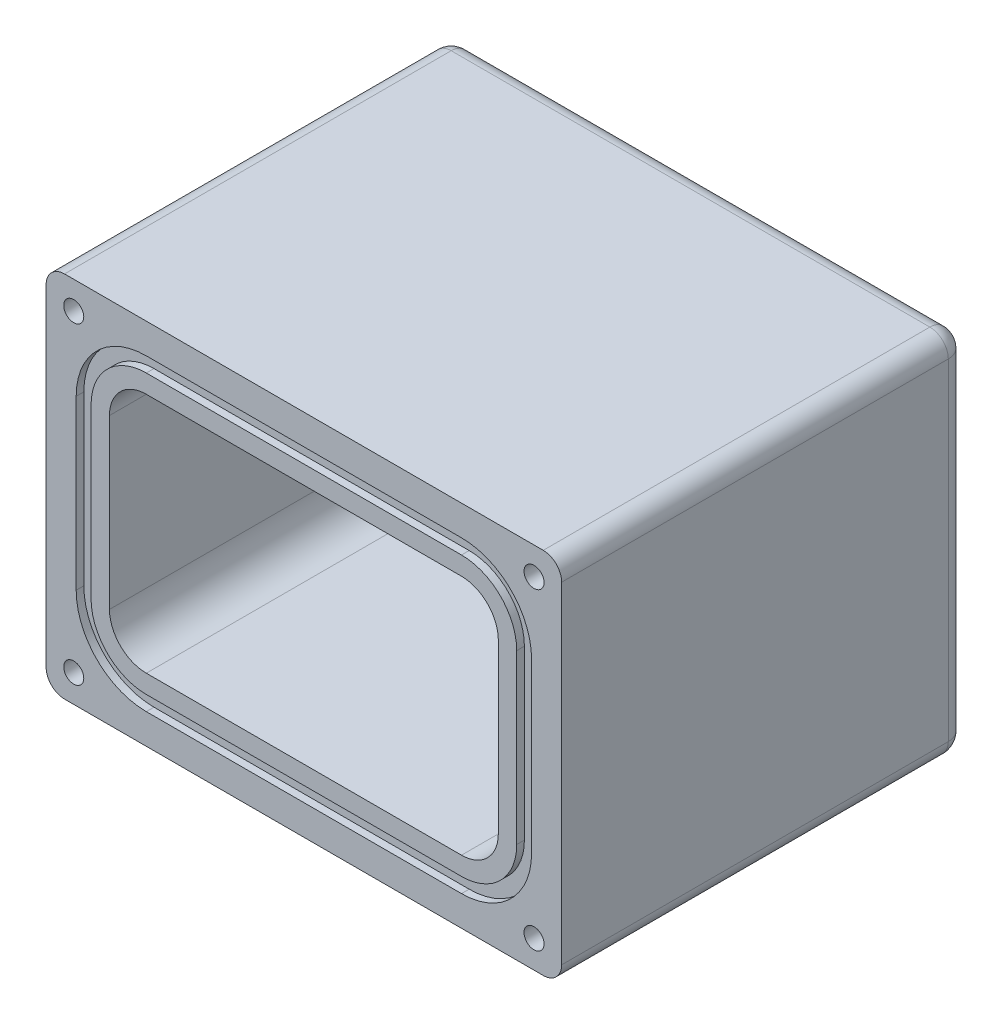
from build123d import *

# Parameters (mm, degrees)
SKETCH1_W                 = 88.9
SKETCH1_H                 = 63.5
BOSS_EXTRUDE1_DEPTH       = 69.85
SKETCH2_W                 = 67.056
SKETCH2_H                 = 41.656
CUT_EXTRUDE1_DEPTH        = 60.96
SKETCH3_R                 = 11.5189
CUT_EXTRUDE2_DEPTH        = 82.853445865
SKETCH4_R                 = 15.9131
SKETCH4_R_2               = 13.3477
CUT_EXTRUDE3_DEPTH        = 1.3208
CUT_EXTRUDE4_DEPTH        = 1.3208
FILLET1_R                 = 6.35
F_6_32_TAPPED_HOLE1_D     = 2.7051
F_6_32_TAPPED_HOLE1_DEPTH = 6.35
F_6_32_TAPPED_HOLE1_TIP   = 0.81269403
FILLET3_R                 = 3.175
F_8_32_TAPPED_HOLE1_D     = 3.4544
F_8_32_TAPPED_HOLE1_DEPTH = 9.525
F_8_32_TAPPED_HOLE1_TIP   = 1.037806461
F_8_32_TAPPED_HOLE2_D     = 3.4544
F_8_32_TAPPED_HOLE2_DEPTH = 6.35
F_8_32_TAPPED_HOLE2_TIP   = 1.037806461


with BuildPart() as part:
    # Sketch1 → Boss-Extrude1 (new body)
    with BuildSketch(Plane.XY):
        Rectangle(SKETCH1_W, SKETCH1_H)
    extrude(amount=BOSS_EXTRUDE1_DEPTH)

    # Sketch2 → Cut-Extrude1 (cut)
    with BuildSketch(Plane.XY.offset(69.85)):
        Rectangle(SKETCH2_W, SKETCH2_H)
    extrude(amount=-CUT_EXTRUDE1_DEPTH, mode=Mode.SUBTRACT)

    # Sketch3 → Cut-Extrude2 (cut, through all)
    with BuildSketch(Plane.XY.offset(8.89)):
        with Locations((-14.357199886, 7.029299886)):
            Circle(SKETCH3_R)
    extrude(amount=-CUT_EXTRUDE2_DEPTH, mode=Mode.SUBTRACT)

    # Sketch4 → Cut-Extrude3 (cut)
    with BuildSketch(Plane(origin=(0, 0, 0), x_dir=(-1, 0, 0), z_dir=(0, 0, -1))):
        with Locations((14.357199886, 7.029299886)):
            Circle(SKETCH4_R)
        with Locations((14.357199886, 7.029299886)):
            Circle(SKETCH4_R_2, mode=Mode.SUBTRACT)
    extrude(amount=-CUT_EXTRUDE3_DEPTH, mode=Mode.SUBTRACT)

    # Sketch6 → Cut-Extrude4 (cut)
    with BuildSketch(Plane.XY.offset(69.85)):
        with BuildLine():
            Line((-27.178, 26.5684), (27.178, 26.5684))
            ThreePointArc((27.178, 26.5684), (35.727203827, 23.027203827), (39.2684, 14.478))
            Line((39.2684, 14.478), (39.2684, -14.478))
            ThreePointArc((39.2684, -14.478), (35.727203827, -23.027203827), (27.178, -26.5684))
            Line((27.178, -26.5684), (-27.178, -26.5684))
            ThreePointArc((-27.178, -26.5684), (-35.727203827, -23.027203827), (-39.2684, -14.478))
            Line((-39.2684, -14.478), (-39.2684, 14.478))
            ThreePointArc((-39.2684, 14.478), (-35.727203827, 23.027203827), (-27.178, 26.5684))
        make_face()
        with BuildLine():
            Line((-27.178, 24.003), (27.178, 24.003))
            ThreePointArc((27.178, 24.003), (33.913192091, 21.213192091), (36.703, 14.478))
            Line((36.703, 14.478), (36.703, -14.478))
            ThreePointArc((36.703, -14.478), (33.913192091, -21.213192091), (27.178, -24.003))
            Line((27.178, -24.003), (-27.178, -24.003))
            ThreePointArc((-27.178, -24.003), (-33.913192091, -21.213192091), (-36.703, -14.478))
            Line((-36.703, -14.478), (-36.703, 14.478))
            ThreePointArc((-36.703, 14.478), (-33.913192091, 21.213192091), (-27.178, 24.003))
        make_face(mode=Mode.SUBTRACT)
    extrude(amount=-CUT_EXTRUDE4_DEPTH, mode=Mode.SUBTRACT)

    # Fillet1
    fillet1_edges = [part.edges().sort_by_distance(p)[0] for p in [
        (33.528, -20.828, 39.37),
        (33.528, 20.828, 39.37),
        (-33.528, 20.828, 39.37),
        (-33.528, -20.828, 39.37),
    ]]
    fillet(fillet1_edges, radius=FILLET1_R)

    # 6-32 Tapped Hole1
    with Locations(Plane(origin=(0, 0, 0), x_dir=(-1, 0, 0), z_dir=(0, 0, -1))):
        with Locations((-7.232800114, 7.029299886), (35.947199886, 7.029299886)):
            Hole(F_6_32_TAPPED_HOLE1_D / 2, depth=F_6_32_TAPPED_HOLE1_DEPTH)
            with Locations((0, 0, -(F_6_32_TAPPED_HOLE1_DEPTH + F_6_32_TAPPED_HOLE1_TIP / 2))):  # 118° drill point
                Cone(0, F_6_32_TAPPED_HOLE1_D / 2, F_6_32_TAPPED_HOLE1_TIP, mode=Mode.SUBTRACT)

    # Fillet3
    fillet3_edges = [part.edges().sort_by_distance(p)[0] for p in [
        (0, 31.75, 0),
        (44.45, 0, 0),
        (0, -31.75, 0),
        (-44.45, 0, 0),
        (-44.45, 31.75, 34.925),
        (44.45, 31.75, 34.925),
        (44.45, -31.75, 34.925),
        (-44.45, -31.75, 34.925),
    ]]
    fillet(fillet3_edges, radius=FILLET3_R)

    # 8-32 Tapped Hole1
    with Locations(Plane.XY.offset(69.85)):
        with Locations((-39.6875, 26.9875), (39.6875, -26.9875), (-39.6875, -26.9875), (39.6875, 26.9875)):
            Hole(F_8_32_TAPPED_HOLE1_D / 2, depth=F_8_32_TAPPED_HOLE1_DEPTH)
            with Locations((0, 0, -(F_8_32_TAPPED_HOLE1_DEPTH + F_8_32_TAPPED_HOLE1_TIP / 2))):  # 118° drill point
                Cone(0, F_8_32_TAPPED_HOLE1_D / 2, F_8_32_TAPPED_HOLE1_TIP, mode=Mode.SUBTRACT)

    # 8-32 Tapped Hole2
    with Locations(Plane.XZ.offset(31.75)):
        with Locations((-8.128, 48.26), (8.128, 57.15), (-8.128, 57.15), (8.128, 48.26)):
            Hole(F_8_32_TAPPED_HOLE2_D / 2, depth=F_8_32_TAPPED_HOLE2_DEPTH)
            with Locations((0, 0, -(F_8_32_TAPPED_HOLE2_DEPTH + F_8_32_TAPPED_HOLE2_TIP / 2))):  # 118° drill point
                Cone(0, F_8_32_TAPPED_HOLE2_D / 2, F_8_32_TAPPED_HOLE2_TIP, mode=Mode.SUBTRACT)


solid = part.part
